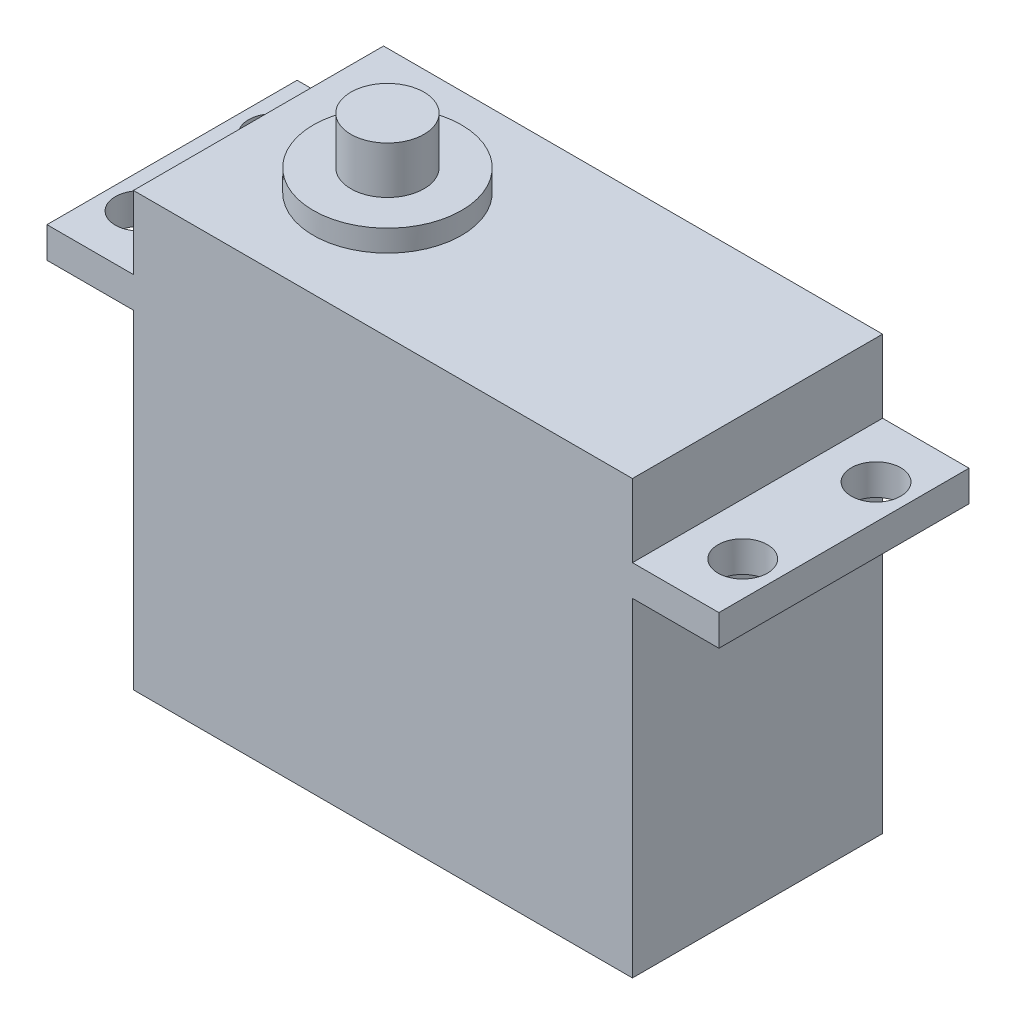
from build123d import *

# Parameters (mm, degrees)
SKETCH1_W           = 40.4
SKETCH1_H           = 20.25
BOSS_EXTRUDE1_DEPTH = 26.62
BOSS_EXTRUDE2_DEPTH = 2.5
SKETCH3_W           = 40.4
SKETCH3_H           = 20.25
BOSS_EXTRUDE3_DEPTH = 5.9
SKETCH4_R           = 2.96
BOSS_EXTRUDE4_DEPTH = 5.57
BOSS_EXTRUDE5_DEPTH = 6.51
SKETCH6_R           = 2
CUT_EXTRUDE1_DEPTH  = 6.51
SKETCH7_R           = 6
BOSS_EXTRUDE6_DEPTH = 1.75


with BuildPart() as part:
    # Sketch1 → Boss-Extrude1 (new body)
    with BuildSketch(Plane(origin=(0, 0, 0), x_dir=(1, 0, 0), z_dir=(0, 1, 0))):
        with Locations((20.2, 10.125)):
            Rectangle(SKETCH1_W, SKETCH1_H)
    extrude(amount=BOSS_EXTRUDE1_DEPTH)

    # Sketch2 → Boss-Extrude2 (add)
    with BuildSketch(Plane(origin=(0, 26.62, 0), x_dir=(-1, 0, 0), z_dir=(0, 1, 0))):
        Polygon((-20.2, 0), (-47.4, 0), (-47.4, -20.25), (7, -20.25), (7, 0), align=None)
    extrude(amount=BOSS_EXTRUDE2_DEPTH)

    # Sketch3 → Boss-Extrude3 (add)
    with BuildSketch(Plane(origin=(0, 29.12, 0), x_dir=(-1, 0, 0), z_dir=(0, 1, 0))):
        with Locations((-20.2, -10.125)):
            Rectangle(SKETCH3_W, SKETCH3_H)
    extrude(amount=BOSS_EXTRUDE3_DEPTH)

    # Sketch4 → Boss-Extrude4 (add)
    with BuildSketch(Plane(origin=(0, 35.02, 0), x_dir=(-1, 0, 0), z_dir=(0, 1, 0))):
        with Locations(Location((-10.44, -10.125, 0), (0, 0, 270))):
            Circle(SKETCH4_R)
    extrude(amount=BOSS_EXTRUDE4_DEPTH)

    # Sketch5 → Boss-Extrude5 (add)
    with BuildSketch(Plane.ZY):
        Polygon((-10.125, 3.35), (-6.88, 3.35), (-6.88, 6.96), (-13.37, 6.96), (-13.37, 3.35), align=None)
    extrude(amount=BOSS_EXTRUDE5_DEPTH)

    # Sketch6 → Cut-Extrude1 (cut)
    with BuildSketch(Plane(origin=(0, 29.12, 0), x_dir=(-1, 0, 0), z_dir=(0, 1, 0))):
        with Locations(Location((4.2, -4.73, 0), (0, 0, 90))):
            Circle(SKETCH6_R)
        with Locations(Location((4.2, -15.52, 0), (0, 0, 90))):
            Circle(SKETCH6_R)
        with Locations(Location((-44.6, -15.52, 0), (0, 0, 90))):
            Circle(SKETCH6_R)
        with Locations(Location((-44.6, -4.73, 0), (0, 0, 90))):
            Circle(SKETCH6_R)
    extrude(amount=-CUT_EXTRUDE1_DEPTH, mode=Mode.SUBTRACT)

    # Sketch7 → Boss-Extrude6 (add)
    with BuildSketch(Plane(origin=(0, 35.02, 0), x_dir=(-1, 0, 0), z_dir=(0, 1, 0))):
        with Locations(Location((-10.44, -10.125, 0), (0, 0, 270))):
            Circle(SKETCH7_R)
    extrude(amount=BOSS_EXTRUDE6_DEPTH)


solid = part.part
